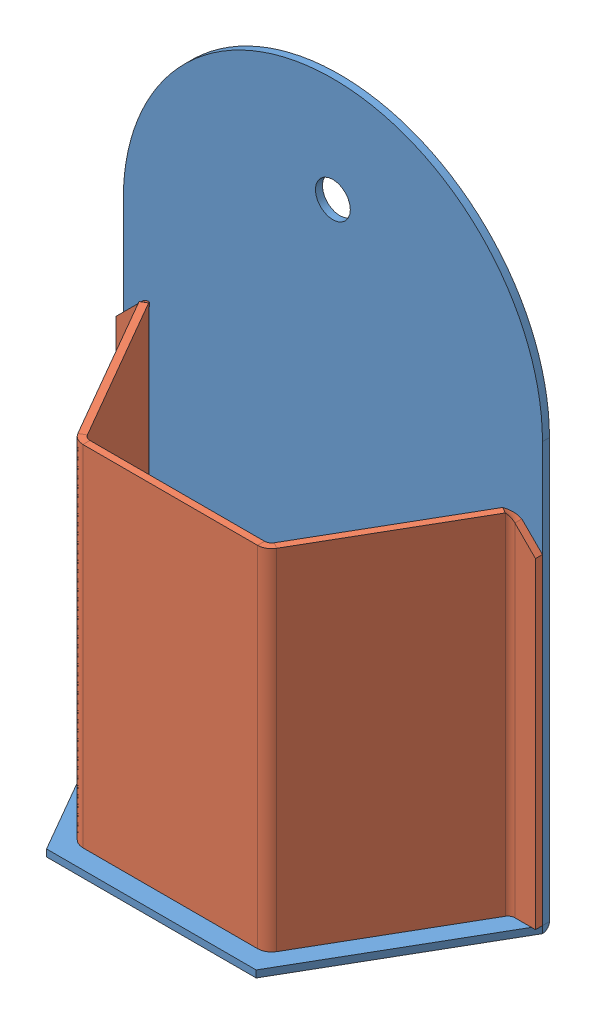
SolidWorks assembly WallMountedContainer2.SLDASM, configuration Default (file format 4100). Lengths in mm.
Overall size (60.06 91 26.98).
2 component instances, 2 part files, 3 mates.
Components (placement in the parent):
- WallMountedContainer2Base-1: WallMountedContainer2Base.SLDPRT [Default] at (2.5368 21.0192 -18.5759) size (60.01 91 26.98)
- WallMountedContainer2Body-1: WallMountedContainer2Body.SLDPRT [Default] at (-38.9905 -38.9818 4.6678) size (60.05 50 23.75)
Mates (geometry in assembly coordinates):
- Coincident1: coincident: plane of WallMountedContainer2Base-1 through (2.5368 -38.9818 -77.5765) normal (0 1 0); plane of WallMountedContainer2Body-1 through (-10.782 -38.9818 52.3401) normal (0 -1 0)
- Coincident2: coincident: plane of WallMountedContainer2Base-1 through (2.5368 21.0192 -17.5759) normal (0 0 1); plane of WallMountedContainer2Body-1 through (-50.4632 -38.9818 -17.5759) normal (0 0 -1)
- Coincident3: coincident aligned: plane of WallMountedContainer2Base-1 through (32.5368 21.0192 -17.5759) normal (1 0 0); plane of WallMountedContainer2Body-1 through (32.5368 -38.9818 -16.5759) normal (1 0 0)
